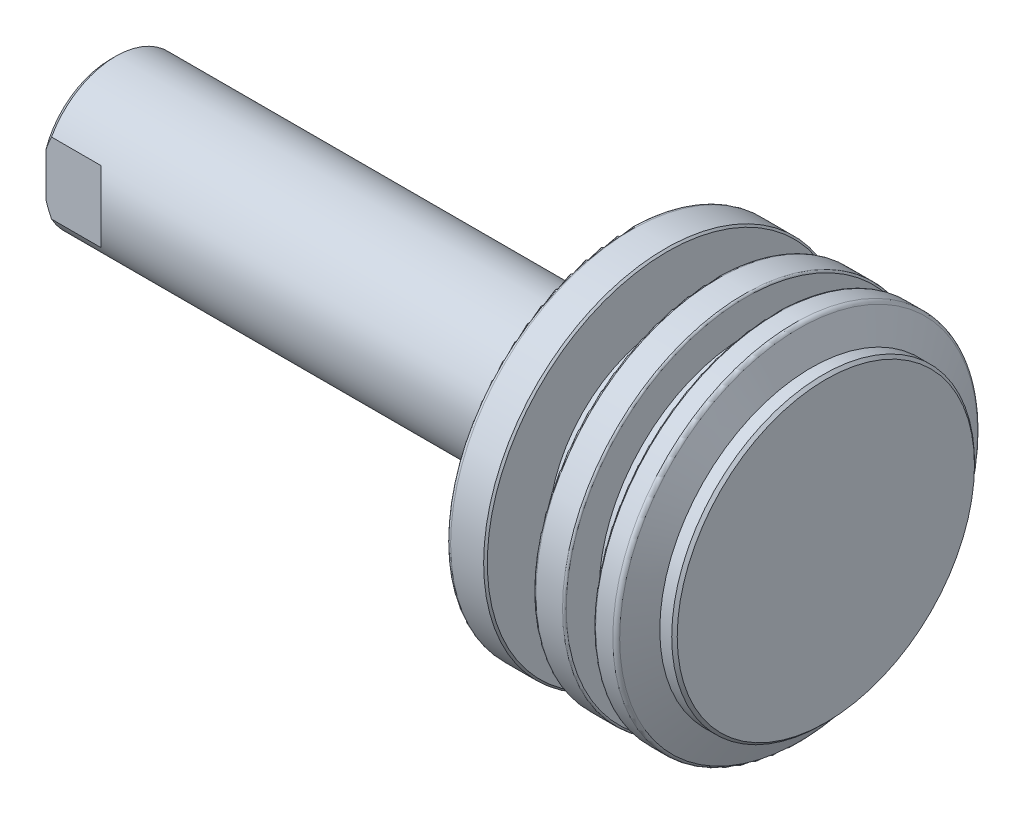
ISO-10303-21;
HEADER;
FILE_DESCRIPTION(('STEP AP214'),'2;1');
FILE_NAME('part.step','',(''),(''),'','','');
FILE_SCHEMA(('AUTOMOTIVE_DESIGN { 1 0 10303 214 1 1 1 1 }'));
ENDSEC;
DATA;
#1=APPLICATION_CONTEXT('core data for automotive mechanical design processes');
#2=APPLICATION_PROTOCOL_DEFINITION('international standard','automotive_design',2000,#1);
#3=PRODUCT_CONTEXT('',#1,'mechanical');
#4=PRODUCT('Part','Part','',(#3));
#5=PRODUCT_RELATED_PRODUCT_CATEGORY('part','',(#4));
#6=PRODUCT_DEFINITION_FORMATION('','',#4);
#7=PRODUCT_DEFINITION_CONTEXT('part definition',#1,'design');
#8=PRODUCT_DEFINITION('design','',#6,#7);
#9=PRODUCT_DEFINITION_SHAPE('','',#8);
#10=(LENGTH_UNIT() NAMED_UNIT(*) SI_UNIT(.MILLI.,.METRE.));
#11=(NAMED_UNIT(*) PLANE_ANGLE_UNIT() SI_UNIT($,.RADIAN.));
#12=(NAMED_UNIT(*) SI_UNIT($,.STERADIAN.) SOLID_ANGLE_UNIT());
#13=UNCERTAINTY_MEASURE_WITH_UNIT(LENGTH_MEASURE(1.E-05),#10,'distance_accuracy_value','');
#14=(GEOMETRIC_REPRESENTATION_CONTEXT(3) GLOBAL_UNCERTAINTY_ASSIGNED_CONTEXT((#13)) GLOBAL_UNIT_ASSIGNED_CONTEXT((#10,
#11,#12)) REPRESENTATION_CONTEXT('',''));
#15=CARTESIAN_POINT('',(0.,0.,0.));
#16=DIRECTION('',(0.,0.,1.));
#17=DIRECTION('',(1.,0.,0.));
#18=AXIS2_PLACEMENT_3D('',#15,#16,#17);
#19=CARTESIAN_POINT('',(78.,16.2,0.));
#20=DIRECTION('',(-1.,0.,0.));
#21=DIRECTION('',(0.,0.,1.));
#22=AXIS2_PLACEMENT_3D('',#19,#20,#21);
#23=PLANE('',#22);
#24=CARTESIAN_POINT('',(78.,0.,0.));
#25=DIRECTION('',(-1.,0.,0.));
#26=DIRECTION('',(0.,-1.,0.));
#27=AXIS2_PLACEMENT_3D('',#24,#25,#26);
#28=CIRCLE('',#27,16.2);
#29=CARTESIAN_POINT('',(78.,-16.2,0.));
#30=VERTEX_POINT('',#29);
#31=EDGE_CURVE('E430',#30,#30,#28,.T.);
#32=ORIENTED_EDGE('',*,*,#31,.F.);
#33=EDGE_LOOP('',(#32));
#34=FACE_BOUND('',#33,.T.);
#35=ADVANCED_FACE('F17',(#34),#23,.F.);
#36=CARTESIAN_POINT('',(77.7,0.,0.));
#37=DIRECTION('',(-1.,0.,0.));
#38=DIRECTION('',(0.,-1.,0.));
#39=AXIS2_PLACEMENT_3D('',#36,#37,#38);
#40=CONICAL_SURFACE('',#39,16.5,0.78539816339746);
#41=CARTESIAN_POINT('',(77.7,0.,0.));
#42=DIRECTION('',(-1.,0.,0.));
#43=DIRECTION('',(0.,0.,1.));
#44=AXIS2_PLACEMENT_3D('',#41,#42,#43);
#45=CIRCLE('',#44,16.5);
#46=CARTESIAN_POINT('',(77.7,0.,16.5));
#47=VERTEX_POINT('',#46);
#48=EDGE_CURVE('E427',#47,#47,#45,.T.);
#49=ORIENTED_EDGE('',*,*,#48,.F.);
#50=EDGE_LOOP('',(#49));
#51=FACE_BOUND('',#50,.T.);
#52=ORIENTED_EDGE('',*,*,#31,.T.);
#53=EDGE_LOOP('',(#52));
#54=FACE_BOUND('',#53,.T.);
#55=ADVANCED_FACE('F334',(#51,#54),#40,.T.);
#56=CARTESIAN_POINT('',(78.,0.,0.));
#57=DIRECTION('',(-1.,0.,0.));
#58=DIRECTION('',(0.,0.,1.));
#59=AXIS2_PLACEMENT_3D('',#56,#57,#58);
#60=CYLINDRICAL_SURFACE('',#59,16.5);
#61=CARTESIAN_POINT('',(76.4,0.,0.));
#62=DIRECTION('',(-1.,0.,0.));
#63=DIRECTION('',(0.,0.,1.));
#64=AXIS2_PLACEMENT_3D('',#61,#62,#63);
#65=CIRCLE('',#64,16.5);
#66=CARTESIAN_POINT('',(76.4,0.,16.5));
#67=VERTEX_POINT('',#66);
#68=EDGE_CURVE('E429',#67,#67,#65,.T.);
#69=ORIENTED_EDGE('',*,*,#68,.F.);
#70=EDGE_LOOP('',(#69));
#71=FACE_BOUND('',#70,.T.);
#72=ORIENTED_EDGE('',*,*,#48,.T.);
#73=EDGE_LOOP('',(#72));
#74=FACE_BOUND('',#73,.T.);
#75=ADVANCED_FACE('F331',(#71,#74),#60,.T.);
#76=CARTESIAN_POINT('',(75.0332266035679,0.,0.));
#77=DIRECTION('',(-1.,0.,0.));
#78=DIRECTION('',(0.,0.,1.));
#79=AXIS2_PLACEMENT_3D('',#76,#77,#78);
#80=CONICAL_SURFACE('',#79,19.5069014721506,1.14416883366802);
#81=CARTESIAN_POINT('',(75.0332266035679,0.,0.));
#82=DIRECTION('',(-1.,0.,0.));
#83=DIRECTION('',(0.,0.,1.));
#84=AXIS2_PLACEMENT_3D('',#81,#82,#83);
#85=CIRCLE('',#84,19.5069014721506);
#86=CARTESIAN_POINT('',(75.0332266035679,0.,19.5069014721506));
#87=VERTEX_POINT('',#86);
#88=EDGE_CURVE('E320',#87,#87,#85,.T.);
#89=ORIENTED_EDGE('',*,*,#88,.F.);
#90=EDGE_LOOP('',(#89));
#91=FACE_BOUND('',#90,.T.);
#92=ORIENTED_EDGE('',*,*,#68,.T.);
#93=EDGE_LOOP('',(#92));
#94=FACE_BOUND('',#93,.T.);
#95=ADVANCED_FACE('F327',(#91,#94),#80,.T.);
#96=CARTESIAN_POINT('',(74.5780433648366,0.,0.));
#97=DIRECTION('',(-1.,0.,0.));
#98=DIRECTION('',(0.,0.,1.));
#99=AXIS2_PLACEMENT_3D('',#96,#97,#98);
#100=TOROIDAL_SURFACE('',#99,19.3,0.500000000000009);
#101=CARTESIAN_POINT('',(74.5780433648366,0.,0.));
#102=DIRECTION('',(-1.,0.,0.));
#103=DIRECTION('',(0.,0.,1.));
#104=AXIS2_PLACEMENT_3D('',#101,#102,#103);
#105=CIRCLE('',#104,19.8);
#106=CARTESIAN_POINT('',(74.5780433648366,0.,19.8));
#107=VERTEX_POINT('',#106);
#108=EDGE_CURVE('E317',#107,#107,#105,.T.);
#109=ORIENTED_EDGE('',*,*,#108,.F.);
#110=EDGE_LOOP('',(#109));
#111=FACE_BOUND('',#110,.T.);
#112=ORIENTED_EDGE('',*,*,#88,.T.);
#113=EDGE_LOOP('',(#112));
#114=FACE_BOUND('',#113,.T.);
#115=ADVANCED_FACE('F324',(#111,#114),#100,.T.);
#116=CARTESIAN_POINT('',(78.,0.,0.));
#117=DIRECTION('',(-1.,0.,0.));
#118=DIRECTION('',(0.,0.,1.));
#119=AXIS2_PLACEMENT_3D('',#116,#117,#118);
#120=CYLINDRICAL_SURFACE('',#119,19.8);
#121=CARTESIAN_POINT('',(72.7,0.,0.));
#122=DIRECTION('',(-1.,0.,0.));
#123=DIRECTION('',(0.,0.,1.));
#124=AXIS2_PLACEMENT_3D('',#121,#122,#123);
#125=CIRCLE('',#124,19.8);
#126=CARTESIAN_POINT('',(72.7,0.,19.8));
#127=VERTEX_POINT('',#126);
#128=EDGE_CURVE('E277',#127,#127,#125,.T.);
#129=ORIENTED_EDGE('',*,*,#128,.F.);
#130=EDGE_LOOP('',(#129));
#131=FACE_BOUND('',#130,.T.);
#132=ORIENTED_EDGE('',*,*,#108,.T.);
#133=EDGE_LOOP('',(#132));
#134=FACE_BOUND('',#133,.T.);
#135=ADVANCED_FACE('F303',(#131,#134),#120,.T.);
#136=CARTESIAN_POINT('',(72.7,0.,0.));
#137=DIRECTION('',(-1.,0.,0.));
#138=DIRECTION('',(0.,0.,1.));
#139=AXIS2_PLACEMENT_3D('',#136,#137,#138);
#140=TOROIDAL_SURFACE('',#139,19.6,0.200000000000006);
#141=CARTESIAN_POINT('',(72.5,0.,0.));
#142=DIRECTION('',(1.,0.,0.));
#143=DIRECTION('',(0.,0.,1.));
#144=AXIS2_PLACEMENT_3D('',#141,#142,#143);
#145=CIRCLE('',#144,19.6);
#146=CARTESIAN_POINT('',(72.5,0.,19.6));
#147=VERTEX_POINT('',#146);
#148=CARTESIAN_POINT('',(72.5,0.,-19.6));
#149=VERTEX_POINT('',#148);
#150=EDGE_CURVE('E268',#147,#149,#145,.T.);
#151=ORIENTED_EDGE('',*,*,#150,.T.);
#152=CARTESIAN_POINT('',(72.5,0.,0.));
#153=DIRECTION('',(1.,0.,0.));
#154=DIRECTION('',(0.,0.,-1.));
#155=AXIS2_PLACEMENT_3D('',#152,#153,#154);
#156=CIRCLE('',#155,19.6);
#157=EDGE_CURVE('E273',#149,#147,#156,.T.);
#158=ORIENTED_EDGE('',*,*,#157,.T.);
#159=EDGE_LOOP('',(#151,#158));
#160=FACE_BOUND('',#159,.T.);
#161=ORIENTED_EDGE('',*,*,#128,.T.);
#162=EDGE_LOOP('',(#161));
#163=FACE_BOUND('',#162,.T.);
#164=ADVANCED_FACE('F270',(#160,#163),#140,.T.);
#165=CARTESIAN_POINT('',(72.5,16.,0.));
#166=DIRECTION('',(1.,0.,0.));
#167=DIRECTION('',(0.,0.,-1.));
#168=AXIS2_PLACEMENT_3D('',#165,#166,#167);
#169=PLANE('',#168);
#170=ORIENTED_EDGE('',*,*,#150,.F.);
#171=ORIENTED_EDGE('',*,*,#157,.F.);
#172=EDGE_LOOP('',(#170,#171));
#173=FACE_BOUND('',#172,.T.);
#174=CARTESIAN_POINT('',(72.5,0.,0.));
#175=DIRECTION('',(-1.,0.,0.));
#176=DIRECTION('',(0.,0.,1.));
#177=AXIS2_PLACEMENT_3D('',#174,#175,#176);
#178=CIRCLE('',#177,16.);
#179=CARTESIAN_POINT('',(72.5,0.,16.));
#180=VERTEX_POINT('',#179);
#181=EDGE_CURVE('E281',#180,#180,#178,.T.);
#182=ORIENTED_EDGE('',*,*,#181,.F.);
#183=EDGE_LOOP('',(#182));
#184=FACE_BOUND('',#183,.T.);
#185=ADVANCED_FACE('F279',(#173,#184),#169,.F.);
#186=CARTESIAN_POINT('',(78.,0.,0.));
#187=DIRECTION('',(-1.,0.,0.));
#188=DIRECTION('',(0.,0.,1.));
#189=AXIS2_PLACEMENT_3D('',#186,#187,#188);
#190=CYLINDRICAL_SURFACE('',#189,16.);
#191=CARTESIAN_POINT('',(69.3,0.,0.));
#192=DIRECTION('',(-1.,0.,0.));
#193=DIRECTION('',(0.,0.,1.));
#194=AXIS2_PLACEMENT_3D('',#191,#192,#193);
#195=CIRCLE('',#194,16.);
#196=CARTESIAN_POINT('',(69.3,0.,16.));
#197=VERTEX_POINT('',#196);
#198=EDGE_CURVE('E443',#197,#197,#195,.F.);
#199=ORIENTED_EDGE('',*,*,#198,.T.);
#200=EDGE_LOOP('',(#199));
#201=FACE_BOUND('',#200,.T.);
#202=ORIENTED_EDGE('',*,*,#181,.T.);
#203=EDGE_LOOP('',(#202));
#204=FACE_BOUND('',#203,.T.);
#205=ADVANCED_FACE('F298',(#201,#204),#190,.T.);
#206=CARTESIAN_POINT('',(69.3,19.6,0.));
#207=DIRECTION('',(-1.,0.,0.));
#208=DIRECTION('',(0.,0.,1.));
#209=AXIS2_PLACEMENT_3D('',#206,#207,#208);
#210=PLANE('',#209);
#211=ORIENTED_EDGE('',*,*,#198,.F.);
#212=EDGE_LOOP('',(#211));
#213=FACE_BOUND('',#212,.T.);
#214=CARTESIAN_POINT('',(69.3,0.,0.));
#215=DIRECTION('',(-1.,0.,0.));
#216=DIRECTION('',(0.,0.,-1.));
#217=AXIS2_PLACEMENT_3D('',#214,#215,#216);
#218=CIRCLE('',#217,19.6);
#219=CARTESIAN_POINT('',(69.3,0.,-19.6));
#220=VERTEX_POINT('',#219);
#221=CARTESIAN_POINT('',(69.3,0.,19.6));
#222=VERTEX_POINT('',#221);
#223=EDGE_CURVE('E446',#220,#222,#218,.T.);
#224=ORIENTED_EDGE('',*,*,#223,.F.);
#225=CARTESIAN_POINT('',(69.3,0.,0.));
#226=DIRECTION('',(-1.,0.,0.));
#227=DIRECTION('',(0.,0.,1.));
#228=AXIS2_PLACEMENT_3D('',#225,#226,#227);
#229=CIRCLE('',#228,19.6);
#230=EDGE_CURVE('E238',#222,#220,#229,.T.);
#231=ORIENTED_EDGE('',*,*,#230,.F.);
#232=EDGE_LOOP('',(#224,#231));
#233=FACE_BOUND('',#232,.T.);
#234=ADVANCED_FACE('F247',(#213,#233),#210,.F.);
#235=CARTESIAN_POINT('',(69.1,0.,0.));
#236=DIRECTION('',(-1.,0.,0.));
#237=DIRECTION('',(0.,0.,1.));
#238=AXIS2_PLACEMENT_3D('',#235,#236,#237);
#239=TOROIDAL_SURFACE('',#238,19.6,0.19999999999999);
#240=CARTESIAN_POINT('',(69.1,0.,0.));
#241=DIRECTION('',(-1.,0.,0.));
#242=DIRECTION('',(0.,0.,1.));
#243=AXIS2_PLACEMENT_3D('',#240,#241,#242);
#244=CIRCLE('',#243,19.8);
#245=CARTESIAN_POINT('',(69.1,0.,19.8));
#246=VERTEX_POINT('',#245);
#247=EDGE_CURVE('E235',#246,#246,#244,.T.);
#248=ORIENTED_EDGE('',*,*,#247,.F.);
#249=EDGE_LOOP('',(#248));
#250=FACE_BOUND('',#249,.T.);
#251=ORIENTED_EDGE('',*,*,#230,.T.);
#252=ORIENTED_EDGE('',*,*,#223,.T.);
#253=EDGE_LOOP('',(#251,#252));
#254=FACE_BOUND('',#253,.T.);
#255=ADVANCED_FACE('F243',(#250,#254),#239,.T.);
#256=CARTESIAN_POINT('',(78.,0.,0.));
#257=DIRECTION('',(-1.,0.,0.));
#258=DIRECTION('',(0.,0.,1.));
#259=AXIS2_PLACEMENT_3D('',#256,#257,#258);
#260=CYLINDRICAL_SURFACE('',#259,19.8);
#261=CARTESIAN_POINT('',(66.2,0.,0.));
#262=DIRECTION('',(-1.,0.,0.));
#263=DIRECTION('',(0.,0.,1.));
#264=AXIS2_PLACEMENT_3D('',#261,#262,#263);
#265=CIRCLE('',#264,19.8);
#266=CARTESIAN_POINT('',(66.2,0.,19.8));
#267=VERTEX_POINT('',#266);
#268=EDGE_CURVE('E227',#267,#267,#265,.T.);
#269=ORIENTED_EDGE('',*,*,#268,.F.);
#270=EDGE_LOOP('',(#269));
#271=FACE_BOUND('',#270,.T.);
#272=ORIENTED_EDGE('',*,*,#247,.T.);
#273=EDGE_LOOP('',(#272));
#274=FACE_BOUND('',#273,.T.);
#275=ADVANCED_FACE('F210',(#271,#274),#260,.T.);
#276=CARTESIAN_POINT('',(66.2,0.,0.));
#277=DIRECTION('',(-1.,0.,0.));
#278=DIRECTION('',(0.,0.,1.));
#279=AXIS2_PLACEMENT_3D('',#276,#277,#278);
#280=TOROIDAL_SURFACE('',#279,19.5,0.300000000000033);
#281=CARTESIAN_POINT('',(65.9,0.,0.));
#282=DIRECTION('',(1.,0.,0.));
#283=DIRECTION('',(0.,0.,1.));
#284=AXIS2_PLACEMENT_3D('',#281,#282,#283);
#285=CIRCLE('',#284,19.5);
#286=CARTESIAN_POINT('',(65.9,0.,19.5));
#287=VERTEX_POINT('',#286);
#288=CARTESIAN_POINT('',(65.9,0.,-19.5));
#289=VERTEX_POINT('',#288);
#290=EDGE_CURVE('E190',#287,#289,#285,.T.);
#291=ORIENTED_EDGE('',*,*,#290,.T.);
#292=CARTESIAN_POINT('',(65.9,0.,0.));
#293=DIRECTION('',(1.,0.,0.));
#294=DIRECTION('',(0.,0.,-1.));
#295=AXIS2_PLACEMENT_3D('',#292,#293,#294);
#296=CIRCLE('',#295,19.5);
#297=EDGE_CURVE('E223',#289,#287,#296,.T.);
#298=ORIENTED_EDGE('',*,*,#297,.T.);
#299=EDGE_LOOP('',(#291,#298));
#300=FACE_BOUND('',#299,.T.);
#301=ORIENTED_EDGE('',*,*,#268,.T.);
#302=EDGE_LOOP('',(#301));
#303=FACE_BOUND('',#302,.T.);
#304=ADVANCED_FACE('F198',(#300,#303),#280,.T.);
#305=CARTESIAN_POINT('',(65.9,12.9,0.));
#306=DIRECTION('',(1.,0.,0.));
#307=DIRECTION('',(0.,0.,-1.));
#308=AXIS2_PLACEMENT_3D('',#305,#306,#307);
#309=PLANE('',#308);
#310=ORIENTED_EDGE('',*,*,#290,.F.);
#311=ORIENTED_EDGE('',*,*,#297,.F.);
#312=EDGE_LOOP('',(#310,#311));
#313=FACE_BOUND('',#312,.T.);
#314=CARTESIAN_POINT('',(65.9,0.,0.));
#315=DIRECTION('',(-1.,0.,0.));
#316=DIRECTION('',(0.,0.,1.));
#317=AXIS2_PLACEMENT_3D('',#314,#315,#316);
#318=CIRCLE('',#317,12.9);
#319=CARTESIAN_POINT('',(65.9,0.,12.9));
#320=VERTEX_POINT('',#319);
#321=EDGE_CURVE('E447',#320,#320,#318,.T.);
#322=ORIENTED_EDGE('',*,*,#321,.F.);
#323=EDGE_LOOP('',(#322));
#324=FACE_BOUND('',#323,.T.);
#325=ADVANCED_FACE('F209',(#313,#324),#309,.F.);
#326=CARTESIAN_POINT('',(78.,0.,0.));
#327=DIRECTION('',(-1.,0.,0.));
#328=DIRECTION('',(0.,0.,1.));
#329=AXIS2_PLACEMENT_3D('',#326,#327,#328);
#330=CYLINDRICAL_SURFACE('',#329,12.9);
#331=CARTESIAN_POINT('',(60.7,0.,0.));
#332=DIRECTION('',(-1.,0.,0.));
#333=DIRECTION('',(0.,0.,1.));
#334=AXIS2_PLACEMENT_3D('',#331,#332,#333);
#335=CIRCLE('',#334,12.9);
#336=CARTESIAN_POINT('',(60.7,0.,12.9));
#337=VERTEX_POINT('',#336);
#338=EDGE_CURVE('E450',#337,#337,#335,.F.);
#339=ORIENTED_EDGE('',*,*,#338,.T.);
#340=EDGE_LOOP('',(#339));
#341=FACE_BOUND('',#340,.T.);
#342=ORIENTED_EDGE('',*,*,#321,.T.);
#343=EDGE_LOOP('',(#342));
#344=FACE_BOUND('',#343,.T.);
#345=ADVANCED_FACE('F601',(#341,#344),#330,.T.);
#346=CARTESIAN_POINT('',(60.7,19.6,0.));
#347=DIRECTION('',(-1.,0.,0.));
#348=DIRECTION('',(0.,0.,1.));
#349=AXIS2_PLACEMENT_3D('',#346,#347,#348);
#350=PLANE('',#349);
#351=ORIENTED_EDGE('',*,*,#338,.F.);
#352=EDGE_LOOP('',(#351));
#353=FACE_BOUND('',#352,.T.);
#354=CARTESIAN_POINT('',(60.7,0.,0.));
#355=DIRECTION('',(-1.,0.,0.));
#356=DIRECTION('',(0.,-1.,0.));
#357=AXIS2_PLACEMENT_3D('',#354,#355,#356);
#358=CIRCLE('',#357,19.6);
#359=CARTESIAN_POINT('',(60.7,-19.6,0.));
#360=VERTEX_POINT('',#359);
#361=EDGE_CURVE('E452',#360,#360,#358,.T.);
#362=ORIENTED_EDGE('',*,*,#361,.F.);
#363=EDGE_LOOP('',(#362));
#364=FACE_BOUND('',#363,.T.);
#365=ADVANCED_FACE('F608',(#353,#364),#350,.F.);
#366=CARTESIAN_POINT('',(60.5,0.,0.));
#367=DIRECTION('',(-1.,0.,0.));
#368=DIRECTION('',(0.,-1.,0.));
#369=AXIS2_PLACEMENT_3D('',#366,#367,#368);
#370=CONICAL_SURFACE('',#369,19.8,0.78539816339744);
#371=CARTESIAN_POINT('',(60.5,0.,0.));
#372=DIRECTION('',(-1.,0.,0.));
#373=DIRECTION('',(0.,0.,1.));
#374=AXIS2_PLACEMENT_3D('',#371,#372,#373);
#375=CIRCLE('',#374,19.8);
#376=CARTESIAN_POINT('',(60.5,0.,19.8));
#377=VERTEX_POINT('',#376);
#378=EDGE_CURVE('E454',#377,#377,#375,.T.);
#379=ORIENTED_EDGE('',*,*,#378,.F.);
#380=EDGE_LOOP('',(#379));
#381=FACE_BOUND('',#380,.T.);
#382=ORIENTED_EDGE('',*,*,#361,.T.);
#383=EDGE_LOOP('',(#382));
#384=FACE_BOUND('',#383,.T.);
#385=ADVANCED_FACE('F616',(#381,#384),#370,.T.);
#386=CARTESIAN_POINT('',(78.,0.,0.));
#387=DIRECTION('',(-1.,0.,0.));
#388=DIRECTION('',(0.,0.,1.));
#389=AXIS2_PLACEMENT_3D('',#386,#387,#388);
#390=CYLINDRICAL_SURFACE('',#389,19.8);
#391=CARTESIAN_POINT('',(56.9,0.,0.));
#392=DIRECTION('',(-1.,0.,0.));
#393=DIRECTION('',(0.,0.,1.));
#394=AXIS2_PLACEMENT_3D('',#391,#392,#393);
#395=CIRCLE('',#394,19.8);
#396=CARTESIAN_POINT('',(56.9,0.,19.8));
#397=VERTEX_POINT('',#396);
#398=EDGE_CURVE('E458',#397,#397,#395,.T.);
#399=ORIENTED_EDGE('',*,*,#398,.F.);
#400=EDGE_LOOP('',(#399));
#401=FACE_BOUND('',#400,.T.);
#402=ORIENTED_EDGE('',*,*,#378,.T.);
#403=EDGE_LOOP('',(#402));
#404=FACE_BOUND('',#403,.T.);
#405=ADVANCED_FACE('F625',(#401,#404),#390,.T.);
#406=CARTESIAN_POINT('',(18.,0.,0.));
#407=DIRECTION('',(-1.,0.,0.));
#408=DIRECTION('',(0.,0.,1.));
#409=AXIS2_PLACEMENT_3D('',#406,#407,#408);
#410=CONICAL_SURFACE('',#409,3.32350000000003,1.04719755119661);
#411=CARTESIAN_POINT('',(19.9188236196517,0.,0.));
#412=VERTEX_POINT('',#411);
#413=VERTEX_LOOP('',#412);
#414=FACE_BOUND('',#413,.T.);
#415=CARTESIAN_POINT('',(18.,0.,0.));
#416=DIRECTION('',(-1.,0.,0.));
#417=DIRECTION('',(0.,0.,1.));
#418=AXIS2_PLACEMENT_3D('',#415,#416,#417);
#419=CIRCLE('',#418,3.3235);
#420=CARTESIAN_POINT('',(18.,0.,3.3235));
#421=VERTEX_POINT('',#420);
#422=EDGE_CURVE('E463',#421,#421,#419,.T.);
#423=ORIENTED_EDGE('',*,*,#422,.T.);
#424=EDGE_LOOP('',(#423));
#425=FACE_BOUND('',#424,.T.);
#426=ADVANCED_FACE('F166',(#414,#425),#410,.F.);
#427=CARTESIAN_POINT('',(56.9,0.,0.));
#428=DIRECTION('',(-1.,0.,0.));
#429=DIRECTION('',(0.,0.,1.));
#430=AXIS2_PLACEMENT_3D('',#427,#428,#429);
#431=TOROIDAL_SURFACE('',#430,19.3,0.499999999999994);
#432=CARTESIAN_POINT('',(56.4,0.,0.));
#433=DIRECTION('',(1.,0.,0.));
#434=DIRECTION('',(0.,0.,1.));
#435=AXIS2_PLACEMENT_3D('',#432,#433,#434);
#436=CIRCLE('',#435,19.3);
#437=CARTESIAN_POINT('',(56.4,0.,19.3));
#438=VERTEX_POINT('',#437);
#439=CARTESIAN_POINT('',(56.4,0.,-19.3));
#440=VERTEX_POINT('',#439);
#441=EDGE_CURVE('E125',#438,#440,#436,.T.);
#442=ORIENTED_EDGE('',*,*,#441,.T.);
#443=CARTESIAN_POINT('',(56.4,0.,0.));
#444=DIRECTION('',(1.,0.,0.));
#445=DIRECTION('',(0.,0.,-1.));
#446=AXIS2_PLACEMENT_3D('',#443,#444,#445);
#447=CIRCLE('',#446,19.3);
#448=EDGE_CURVE('E157',#440,#438,#447,.T.);
#449=ORIENTED_EDGE('',*,*,#448,.T.);
#450=EDGE_LOOP('',(#442,#449));
#451=FACE_BOUND('',#450,.T.);
#452=ORIENTED_EDGE('',*,*,#398,.T.);
#453=EDGE_LOOP('',(#452));
#454=FACE_BOUND('',#453,.T.);
#455=ADVANCED_FACE('F162',(#451,#454),#431,.T.);
#456=CARTESIAN_POINT('',(19.9188236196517,0.,0.));
#457=DIRECTION('',(-1.,0.,0.));
#458=DIRECTION('',(0.,0.,1.));
#459=AXIS2_PLACEMENT_3D('',#456,#457,#458);
#460=CYLINDRICAL_SURFACE('',#459,3.3235);
#461=ORIENTED_EDGE('',*,*,#422,.F.);
#462=EDGE_LOOP('',(#461));
#463=FACE_BOUND('',#462,.T.);
#464=CARTESIAN_POINT('',(0.676499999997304,0.,0.));
#465=DIRECTION('',(-1.,0.,0.));
#466=DIRECTION('',(0.,0.,1.));
#467=AXIS2_PLACEMENT_3D('',#464,#465,#466);
#468=CIRCLE('',#467,3.3235000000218);
#469=CARTESIAN_POINT('',(0.676499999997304,0.,3.3235000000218));
#470=VERTEX_POINT('',#469);
#471=EDGE_CURVE('E149',#470,#470,#468,.T.);
#472=ORIENTED_EDGE('',*,*,#471,.T.);
#473=EDGE_LOOP('',(#472));
#474=FACE_BOUND('',#473,.T.);
#475=ADVANCED_FACE('F142',(#463,#474),#460,.F.);
#476=CARTESIAN_POINT('',(56.4,16.5,0.));
#477=DIRECTION('',(1.,0.,0.));
#478=DIRECTION('',(0.,0.,-1.));
#479=AXIS2_PLACEMENT_3D('',#476,#477,#478);
#480=PLANE('',#479);
#481=ORIENTED_EDGE('',*,*,#441,.F.);
#482=ORIENTED_EDGE('',*,*,#448,.F.);
#483=EDGE_LOOP('',(#481,#482));
#484=FACE_BOUND('',#483,.T.);
#485=CARTESIAN_POINT('',(56.4,0.,0.));
#486=DIRECTION('',(1.,0.,0.));
#487=DIRECTION('',(0.,1.,0.));
#488=AXIS2_PLACEMENT_3D('',#485,#486,#487);
#489=CIRCLE('',#488,16.5);
#490=CARTESIAN_POINT('',(56.4,16.5,0.));
#491=VERTEX_POINT('',#490);
#492=EDGE_CURVE('E84',#491,#491,#489,.F.);
#493=ORIENTED_EDGE('',*,*,#492,.F.);
#494=EDGE_LOOP('',(#493));
#495=FACE_BOUND('',#494,.T.);
#496=ADVANCED_FACE('F131',(#484,#495),#480,.F.);
#497=CARTESIAN_POINT('',(1.70530256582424E-10,0.,0.));
#498=DIRECTION('',(-1.,0.,0.));
#499=DIRECTION('',(0.,0.,1.));
#500=AXIS2_PLACEMENT_3D('',#497,#498,#499);
#501=CONICAL_SURFACE('',#500,3.99999999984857,0.785398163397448);
#502=ORIENTED_EDGE('',*,*,#471,.F.);
#503=EDGE_LOOP('',(#502));
#504=FACE_BOUND('',#503,.T.);
#505=CARTESIAN_POINT('',(5.6843418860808E-11,0.,0.));
#506=DIRECTION('',(-1.,0.,0.));
#507=DIRECTION('',(0.,0.,1.));
#508=AXIS2_PLACEMENT_3D('',#505,#506,#507);
#509=CIRCLE('',#508,3.99999999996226);
#510=CARTESIAN_POINT('',(5.6843418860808E-11,0.,3.99999999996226));
#511=VERTEX_POINT('',#510);
#512=EDGE_CURVE('E92',#511,#511,#509,.T.);
#513=ORIENTED_EDGE('',*,*,#512,.T.);
#514=EDGE_LOOP('',(#513));
#515=FACE_BOUND('',#514,.T.);
#516=ADVANCED_FACE('F141',(#504,#515),#501,.F.);
#517=CARTESIAN_POINT('',(56.4,0.,0.));
#518=DIRECTION('',(1.,0.,0.));
#519=DIRECTION('',(0.,1.,0.));
#520=AXIS2_PLACEMENT_3D('',#517,#518,#519);
#521=CONICAL_SURFACE('',#520,16.5,0.785398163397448);
#522=CARTESIAN_POINT('',(55.9,0.,0.));
#523=DIRECTION('',(1.,0.,0.));
#524=DIRECTION('',(0.,1.,0.));
#525=AXIS2_PLACEMENT_3D('',#522,#523,#524);
#526=CIRCLE('',#525,16.);
#527=CARTESIAN_POINT('',(55.9,16.,0.));
#528=VERTEX_POINT('',#527);
#529=EDGE_CURVE('E118',#528,#528,#526,.T.);
#530=ORIENTED_EDGE('',*,*,#529,.T.);
#531=EDGE_LOOP('',(#530));
#532=FACE_BOUND('',#531,.T.);
#533=ORIENTED_EDGE('',*,*,#492,.T.);
#534=EDGE_LOOP('',(#533));
#535=FACE_BOUND('',#534,.T.);
#536=ADVANCED_FACE('F382',(#532,#535),#521,.T.);
#537=CARTESIAN_POINT('',(0.600000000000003,0.,0.));
#538=DIRECTION('',(1.,0.,0.));
#539=DIRECTION('',(0.,0.,-1.));
#540=AXIS2_PLACEMENT_3D('',#537,#538,#539);
#541=CONICAL_SURFACE('',#540,8.,0.785398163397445);
#542=CARTESIAN_POINT('',(0.,0.,0.));
#543=DIRECTION('',(1.,0.,0.));
#544=DIRECTION('',(0.,0.,-1.));
#545=AXIS2_PLACEMENT_3D('',#542,#543,#544);
#546=CIRCLE('',#545,7.4);
#547=CARTESIAN_POINT('',(0.,2.4,-7.));
#548=VERTEX_POINT('',#547);
#549=CARTESIAN_POINT('',(0.,2.4,7.));
#550=VERTEX_POINT('',#549);
#551=EDGE_CURVE('E78',#548,#550,#546,.T.);
#552=ORIENTED_EDGE('',*,*,#551,.T.);
#553=CARTESIAN_POINT('',(0.,2.4,7.));
#554=CARTESIAN_POINT('',(0.040954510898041,2.52626992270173,7.));
#555=CARTESIAN_POINT('',(0.0845159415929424,2.65167368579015,7.));
#556=CARTESIAN_POINT('',(0.176287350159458,2.90060474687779,7.));
#557=CARTESIAN_POINT('',(0.224491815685,3.02413407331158,7.));
#558=CARTESIAN_POINT('',(0.325074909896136,3.26944985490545,7.));
#559=CARTESIAN_POINT('',(0.37745290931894,3.39123656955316,7.));
#560=CARTESIAN_POINT('',(0.486003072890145,3.63328143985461,7.));
#561=CARTESIAN_POINT('',(0.542179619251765,3.75353763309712,7.));
#562=CARTESIAN_POINT('',(0.600000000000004,3.87298334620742,7.));
#563=B_SPLINE_CURVE_WITH_KNOTS('',3,(#553,#554,#555,#556,#557,#558,#559,#560,#561,#562),
.UNSPECIFIED.,.F.,.F.,(4,2,2,2,4),(0.,0.3981799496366,0.795892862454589,1.19354592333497,
1.59166583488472),.UNSPECIFIED.);
#564=CARTESIAN_POINT('',(0.600000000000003,3.87298334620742,7.));
#565=VERTEX_POINT('',#564);
#566=EDGE_CURVE('E83',#550,#565,#563,.T.);
#567=ORIENTED_EDGE('',*,*,#566,.T.);
#568=CARTESIAN_POINT('',(0.600000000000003,0.,0.));
#569=DIRECTION('',(-1.,0.,0.));
#570=DIRECTION('',(0.,0.,1.));
#571=AXIS2_PLACEMENT_3D('',#568,#569,#570);
#572=CIRCLE('',#571,8.);
#573=CARTESIAN_POINT('',(0.600000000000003,3.87298334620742,-7.));
#574=VERTEX_POINT('',#573);
#575=EDGE_CURVE('E81',#574,#565,#572,.F.);
#576=ORIENTED_EDGE('',*,*,#575,.F.);
#577=CARTESIAN_POINT('',(0.600000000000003,3.87298334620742,-7.));
#578=CARTESIAN_POINT('',(0.542179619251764,3.75353763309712,-7.));
#579=CARTESIAN_POINT('',(0.486003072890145,3.63328143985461,-7.));
#580=CARTESIAN_POINT('',(0.37745290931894,3.39123656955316,-7.));
#581=CARTESIAN_POINT('',(0.325074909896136,3.26944985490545,-7.));
#582=CARTESIAN_POINT('',(0.224491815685,3.02413407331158,-7.));
#583=CARTESIAN_POINT('',(0.176287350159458,2.90060474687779,-7.));
#584=CARTESIAN_POINT('',(0.0845159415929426,2.65167368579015,-7.));
#585=CARTESIAN_POINT('',(0.0409545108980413,2.52626992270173,-7.));
#586=CARTESIAN_POINT('',(0.,2.4,-7.));
#587=B_SPLINE_CURVE_WITH_KNOTS('',3,(#577,#578,#579,#580,#581,#582,#583,#584,#585,#586),
.UNSPECIFIED.,.F.,.F.,(4,2,2,2,4),(0.,0.398119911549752,0.795772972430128,1.19348588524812,
1.59166583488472),.UNSPECIFIED.);
#588=EDGE_CURVE('E72',#574,#548,#587,.T.);
#589=ORIENTED_EDGE('',*,*,#588,.T.);
#590=EDGE_LOOP('',(#552,#567,#576,#589));
#591=FACE_BOUND('',#590,.T.);
#592=ADVANCED_FACE('F77',(#591),#541,.T.);
#593=CARTESIAN_POINT('',(0.,0.,0.));
#594=DIRECTION('',(1.,0.,0.));
#595=DIRECTION('',(0.,0.,-1.));
#596=AXIS2_PLACEMENT_3D('',#593,#594,#595);
#597=PLANE('',#596);
#598=ORIENTED_EDGE('',*,*,#512,.F.);
#599=EDGE_LOOP('',(#598));
#600=FACE_BOUND('',#599,.T.);
#601=DIRECTION('',(0.,1.,0.));
#602=VECTOR('',#601,1.);
#603=CARTESIAN_POINT('',(0.,-10.,-7.));
#604=LINE('',#603,#602);
#605=CARTESIAN_POINT('',(0.,-2.4,-7.));
#606=VERTEX_POINT('',#605);
#607=EDGE_CURVE('E88',#548,#606,#604,.F.);
#608=ORIENTED_EDGE('',*,*,#607,.T.);
#609=CARTESIAN_POINT('',(0.,0.,0.));
#610=DIRECTION('',(1.,0.,0.));
#611=DIRECTION('',(0.,0.,-1.));
#612=AXIS2_PLACEMENT_3D('',#609,#610,#611);
#613=CIRCLE('',#612,7.4);
#614=CARTESIAN_POINT('',(0.,-2.4,7.));
#615=VERTEX_POINT('',#614);
#616=EDGE_CURVE('E102',#615,#606,#613,.T.);
#617=ORIENTED_EDGE('',*,*,#616,.F.);
#618=DIRECTION('',(0.,1.,0.));
#619=VECTOR('',#618,1.);
#620=CARTESIAN_POINT('',(0.,-10.,7.));
#621=LINE('',#620,#619);
#622=EDGE_CURVE('E91',#615,#550,#621,.T.);
#623=ORIENTED_EDGE('',*,*,#622,.T.);
#624=ORIENTED_EDGE('',*,*,#551,.F.);
#625=EDGE_LOOP('',(#608,#617,#623,#624));
#626=FACE_BOUND('',#625,.T.);
#627=ADVANCED_FACE('F87',(#600,#626),#597,.F.);
#628=CARTESIAN_POINT('',(55.9,8.,0.));
#629=DIRECTION('',(1.,0.,0.));
#630=DIRECTION('',(0.,0.,-1.));
#631=AXIS2_PLACEMENT_3D('',#628,#629,#630);
#632=PLANE('',#631);
#633=ORIENTED_EDGE('',*,*,#529,.F.);
#634=EDGE_LOOP('',(#633));
#635=FACE_BOUND('',#634,.T.);
#636=CARTESIAN_POINT('',(55.9,0.,0.));
#637=DIRECTION('',(-1.,0.,0.));
#638=DIRECTION('',(0.,0.,1.));
#639=AXIS2_PLACEMENT_3D('',#636,#637,#638);
#640=CIRCLE('',#639,8.);
#641=CARTESIAN_POINT('',(55.9,0.,8.));
#642=VERTEX_POINT('',#641);
#643=EDGE_CURVE('E422',#642,#642,#640,.T.);
#644=ORIENTED_EDGE('',*,*,#643,.F.);
#645=EDGE_LOOP('',(#644));
#646=FACE_BOUND('',#645,.T.);
#647=ADVANCED_FACE('F413',(#635,#646),#632,.F.);
#648=CARTESIAN_POINT('',(13.0710678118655,-10.,14.0710678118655));
#649=DIRECTION('',(0.707106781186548,0.,-0.707106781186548));
#650=DIRECTION('',(-0.707106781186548,0.,-0.707106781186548));
#651=AXIS2_PLACEMENT_3D('',#648,#649,#650);
#652=PLANE('',#651);
#653=CARTESIAN_POINT('',(-1.00000000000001,0.,0.));
#654=DIRECTION('',(0.707106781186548,0.,-0.707106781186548));
#655=DIRECTION('',(-0.707106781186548,0.,-0.707106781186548));
#656=AXIS2_PLACEMENT_3D('',#653,#654,#655);
#657=ELLIPSE('',#656,11.3137084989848,8.);
#658=CARTESIAN_POINT('',(5.99999999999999,3.87298334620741,7.));
#659=VERTEX_POINT('',#658);
#660=CARTESIAN_POINT('',(6.,-3.87298334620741,7.));
#661=VERTEX_POINT('',#660);
#662=EDGE_CURVE('E423',#659,#661,#657,.T.);
#663=ORIENTED_EDGE('',*,*,#662,.F.);
#664=DIRECTION('',(0.,1.,0.));
#665=VECTOR('',#664,1.);
#666=CARTESIAN_POINT('',(6.,-10.,7.));
#667=LINE('',#666,#665);
#668=EDGE_CURVE('E114',#659,#661,#667,.F.);
#669=ORIENTED_EDGE('',*,*,#668,.T.);
#670=EDGE_LOOP('',(#663,#669));
#671=FACE_BOUND('',#670,.T.);
#672=ADVANCED_FACE('F409',(#671),#652,.F.);
#673=CARTESIAN_POINT('',(6.,-10.,7.));
#674=DIRECTION('',(0.,0.,-1.));
#675=DIRECTION('',(-1.,0.,0.));
#676=AXIS2_PLACEMENT_3D('',#673,#674,#675);
#677=PLANE('',#676);
#678=ORIENTED_EDGE('',*,*,#668,.F.);
#679=DIRECTION('',(-1.,0.,0.));
#680=VECTOR('',#679,1.);
#681=CARTESIAN_POINT('',(6.,3.87298334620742,7.));
#682=LINE('',#681,#680);
#683=EDGE_CURVE('E111',#565,#659,#682,.F.);
#684=ORIENTED_EDGE('',*,*,#683,.F.);
#685=ORIENTED_EDGE('',*,*,#566,.F.);
#686=ORIENTED_EDGE('',*,*,#622,.F.);
#687=CARTESIAN_POINT('',(0.600000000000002,-3.87298334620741,7.));
#688=CARTESIAN_POINT('',(0.542179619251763,-3.75353763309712,7.));
#689=CARTESIAN_POINT('',(0.486003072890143,-3.63328143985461,7.));
#690=CARTESIAN_POINT('',(0.377452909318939,-3.39123656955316,7.));
#691=CARTESIAN_POINT('',(0.325074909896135,-3.26944985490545,7.));
#692=CARTESIAN_POINT('',(0.224491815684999,-3.02413407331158,7.));
#693=CARTESIAN_POINT('',(0.176287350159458,-2.90060474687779,7.));
#694=CARTESIAN_POINT('',(0.0845159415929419,-2.65167368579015,7.));
#695=CARTESIAN_POINT('',(0.0409545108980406,-2.52626992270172,7.));
#696=CARTESIAN_POINT('',(0.,-2.4,7.));
#697=B_SPLINE_CURVE_WITH_KNOTS('',3,(#687,#688,#689,#690,#691,#692,#693,#694,#695,#696),
.UNSPECIFIED.,.F.,.F.,(4,2,2,2,4),(0.,0.398119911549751,0.795772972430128,1.19348588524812,
1.59166583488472),.UNSPECIFIED.);
#698=CARTESIAN_POINT('',(0.600000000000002,-3.87298334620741,7.));
#699=VERTEX_POINT('',#698);
#700=EDGE_CURVE('E97',#699,#615,#697,.T.);
#701=ORIENTED_EDGE('',*,*,#700,.F.);
#702=DIRECTION('',(-1.,0.,0.));
#703=VECTOR('',#702,1.);
#704=CARTESIAN_POINT('',(78.,-3.87298334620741,7.));
#705=LINE('',#704,#703);
#706=EDGE_CURVE('E110',#661,#699,#705,.T.);
#707=ORIENTED_EDGE('',*,*,#706,.F.);
#708=EDGE_LOOP('',(#678,#684,#685,#686,#701,#707));
#709=FACE_BOUND('',#708,.T.);
#710=ADVANCED_FACE('F405',(#709),#677,.F.);
#711=CARTESIAN_POINT('',(0.600000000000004,0.,0.));
#712=DIRECTION('',(1.,0.,0.));
#713=DIRECTION('',(0.,0.,-1.));
#714=AXIS2_PLACEMENT_3D('',#711,#712,#713);
#715=CONICAL_SURFACE('',#714,8.,0.785398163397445);
#716=CARTESIAN_POINT('',(0.600000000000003,0.,0.));
#717=DIRECTION('',(-1.,0.,0.));
#718=DIRECTION('',(0.,0.,1.));
#719=AXIS2_PLACEMENT_3D('',#716,#717,#718);
#720=CIRCLE('',#719,8.);
#721=CARTESIAN_POINT('',(0.600000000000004,-3.87298334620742,-7.));
#722=VERTEX_POINT('',#721);
#723=EDGE_CURVE('E107',#699,#722,#720,.F.);
#724=ORIENTED_EDGE('',*,*,#723,.F.);
#725=ORIENTED_EDGE('',*,*,#700,.T.);
#726=ORIENTED_EDGE('',*,*,#616,.T.);
#727=CARTESIAN_POINT('',(0.,-2.4,-7.));
#728=CARTESIAN_POINT('',(0.0409545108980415,-2.52626992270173,-7.));
#729=CARTESIAN_POINT('',(0.0845159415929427,-2.65167368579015,-7.));
#730=CARTESIAN_POINT('',(0.176287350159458,-2.90060474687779,-7.));
#731=CARTESIAN_POINT('',(0.224491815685,-3.02413407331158,-7.));
#732=CARTESIAN_POINT('',(0.325074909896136,-3.26944985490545,-7.));
#733=CARTESIAN_POINT('',(0.37745290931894,-3.39123656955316,-7.));
#734=CARTESIAN_POINT('',(0.486003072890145,-3.63328143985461,-7.));
#735=CARTESIAN_POINT('',(0.542179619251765,-3.75353763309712,-7.));
#736=CARTESIAN_POINT('',(0.600000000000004,-3.87298334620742,-7.));
#737=B_SPLINE_CURVE_WITH_KNOTS('',3,(#727,#728,#729,#730,#731,#732,#733,#734,#735,#736),
.UNSPECIFIED.,.F.,.F.,(4,2,2,2,4),(0.,0.3981799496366,0.795892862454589,1.19354592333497,
1.59166583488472),.UNSPECIFIED.);
#738=EDGE_CURVE('E96',#606,#722,#737,.T.);
#739=ORIENTED_EDGE('',*,*,#738,.T.);
#740=EDGE_LOOP('',(#724,#725,#726,#739));
#741=FACE_BOUND('',#740,.T.);
#742=ADVANCED_FACE('F361',(#741),#715,.T.);
#743=CARTESIAN_POINT('',(0.,-10.,-7.));
#744=DIRECTION('',(0.,0.,1.));
#745=DIRECTION('',(1.,0.,0.));
#746=AXIS2_PLACEMENT_3D('',#743,#744,#745);
#747=PLANE('',#746);
#748=DIRECTION('',(0.,1.,0.));
#749=VECTOR('',#748,1.);
#750=CARTESIAN_POINT('',(6.,-10.,-7.));
#751=LINE('',#750,#749);
#752=CARTESIAN_POINT('',(6.,3.87298334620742,-7.));
#753=VERTEX_POINT('',#752);
#754=CARTESIAN_POINT('',(6.,-3.87298334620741,-7.));
#755=VERTEX_POINT('',#754);
#756=EDGE_CURVE('E37',#753,#755,#751,.F.);
#757=ORIENTED_EDGE('',*,*,#756,.T.);
#758=DIRECTION('',(-1.,0.,0.));
#759=VECTOR('',#758,1.);
#760=CARTESIAN_POINT('',(78.,-3.87298334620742,-7.));
#761=LINE('',#760,#759);
#762=EDGE_CURVE('E28',#722,#755,#761,.F.);
#763=ORIENTED_EDGE('',*,*,#762,.F.);
#764=ORIENTED_EDGE('',*,*,#738,.F.);
#765=ORIENTED_EDGE('',*,*,#607,.F.);
#766=ORIENTED_EDGE('',*,*,#588,.F.);
#767=DIRECTION('',(1.,0.,0.));
#768=VECTOR('',#767,1.);
#769=CARTESIAN_POINT('',(0.,3.87298334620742,-7.));
#770=LINE('',#769,#768);
#771=EDGE_CURVE('E99',#753,#574,#770,.F.);
#772=ORIENTED_EDGE('',*,*,#771,.F.);
#773=EDGE_LOOP('',(#757,#763,#764,#765,#766,#772));
#774=FACE_BOUND('',#773,.T.);
#775=ADVANCED_FACE('F95',(#774),#747,.F.);
#776=CARTESIAN_POINT('',(6.,-10.,-7.));
#777=DIRECTION('',(0.707106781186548,0.,0.707106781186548));
#778=DIRECTION('',(0.707106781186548,0.,-0.707106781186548));
#779=AXIS2_PLACEMENT_3D('',#776,#777,#778);
#780=PLANE('',#779);
#781=ORIENTED_EDGE('',*,*,#756,.F.);
#782=CARTESIAN_POINT('',(-1.,0.,0.));
#783=DIRECTION('',(0.707106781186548,0.,0.707106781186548));
#784=DIRECTION('',(-0.707106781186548,0.,0.707106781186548));
#785=AXIS2_PLACEMENT_3D('',#782,#783,#784);
#786=ELLIPSE('',#785,11.3137084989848,8.);
#787=EDGE_CURVE('E11',#755,#753,#786,.T.);
#788=ORIENTED_EDGE('',*,*,#787,.F.);
#789=EDGE_LOOP('',(#781,#788));
#790=FACE_BOUND('',#789,.T.);
#791=ADVANCED_FACE('F347',(#790),#780,.F.);
#792=CARTESIAN_POINT('',(78.,0.,0.));
#793=DIRECTION('',(-1.,0.,0.));
#794=DIRECTION('',(0.,0.,1.));
#795=AXIS2_PLACEMENT_3D('',#792,#793,#794);
#796=CYLINDRICAL_SURFACE('',#795,8.);
#797=ORIENTED_EDGE('',*,*,#643,.T.);
#798=EDGE_LOOP('',(#797));
#799=FACE_BOUND('',#798,.T.);
#800=ORIENTED_EDGE('',*,*,#762,.T.);
#801=ORIENTED_EDGE('',*,*,#787,.T.);
#802=ORIENTED_EDGE('',*,*,#771,.T.);
#803=ORIENTED_EDGE('',*,*,#575,.T.);
#804=ORIENTED_EDGE('',*,*,#683,.T.);
#805=ORIENTED_EDGE('',*,*,#662,.T.);
#806=ORIENTED_EDGE('',*,*,#706,.T.);
#807=ORIENTED_EDGE('',*,*,#723,.T.);
#808=EDGE_LOOP('',(#800,#801,#802,#803,#804,#805,#806,#807));
#809=FACE_BOUND('',#808,.T.);
#810=ADVANCED_FACE('F345',(#799,#809),#796,.T.);
#811=CLOSED_SHELL('',(#35,#55,#75,#95,#115,#135,#164,#185,#205,#234,#255,#275,#304,#325,#345,
#365,#385,#405,#426,#455,#475,#496,#516,#536,#592,#627,#647,#672,#710,#742,#775,#791,#810));
#812=MANIFOLD_SOLID_BREP('B1',#811);
#813=ADVANCED_BREP_SHAPE_REPRESENTATION('',(#18,#812),#14);
#814=SHAPE_DEFINITION_REPRESENTATION(#9,#813);
ENDSEC;
END-ISO-10303-21;
